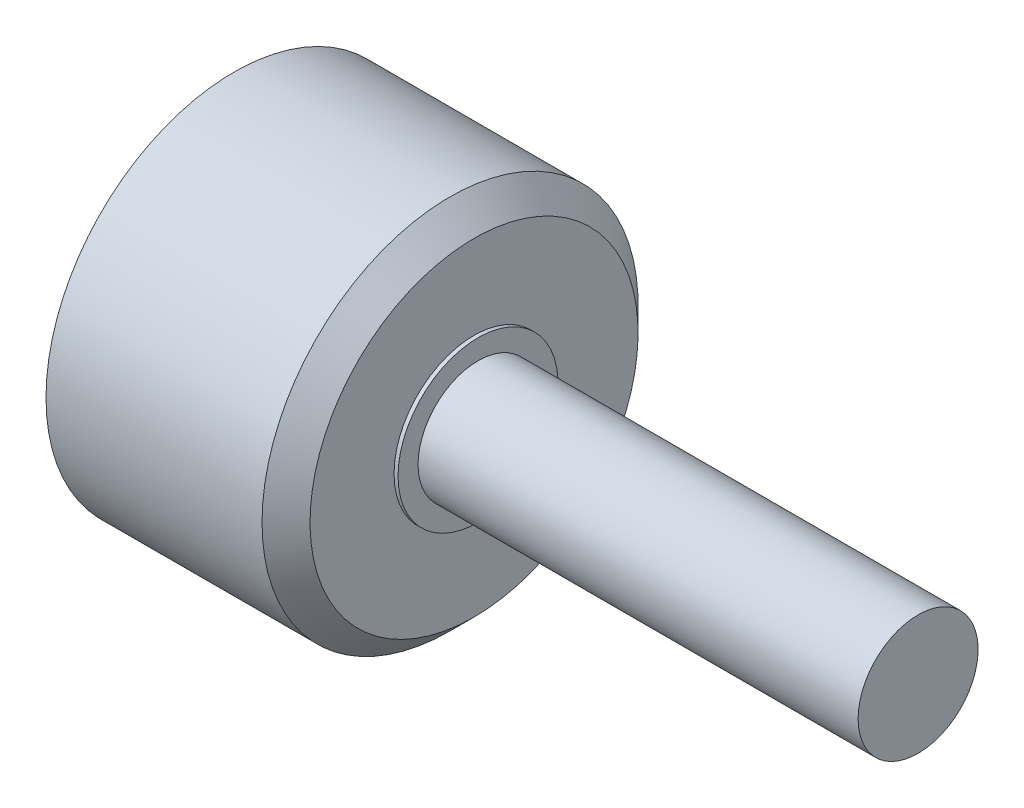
ISO-10303-21;
HEADER;
FILE_DESCRIPTION(('STEP AP214'),'2;1');
FILE_NAME('part.step','',(''),(''),'','','');
FILE_SCHEMA(('AUTOMOTIVE_DESIGN { 1 0 10303 214 1 1 1 1 }'));
ENDSEC;
DATA;
#1=APPLICATION_CONTEXT('core data for automotive mechanical design processes');
#2=APPLICATION_PROTOCOL_DEFINITION('international standard','automotive_design',2000,#1);
#3=PRODUCT_CONTEXT('',#1,'mechanical');
#4=PRODUCT('Part','Part','',(#3));
#5=PRODUCT_RELATED_PRODUCT_CATEGORY('part','',(#4));
#6=PRODUCT_DEFINITION_FORMATION('','',#4);
#7=PRODUCT_DEFINITION_CONTEXT('part definition',#1,'design');
#8=PRODUCT_DEFINITION('design','',#6,#7);
#9=PRODUCT_DEFINITION_SHAPE('','',#8);
#10=(LENGTH_UNIT() NAMED_UNIT(*) SI_UNIT(.MILLI.,.METRE.));
#11=(NAMED_UNIT(*) PLANE_ANGLE_UNIT() SI_UNIT($,.RADIAN.));
#12=(NAMED_UNIT(*) SI_UNIT($,.STERADIAN.) SOLID_ANGLE_UNIT());
#13=UNCERTAINTY_MEASURE_WITH_UNIT(LENGTH_MEASURE(1.E-05),#10,'distance_accuracy_value','');
#14=(GEOMETRIC_REPRESENTATION_CONTEXT(3) GLOBAL_UNCERTAINTY_ASSIGNED_CONTEXT((#13)) GLOBAL_UNIT_ASSIGNED_CONTEXT((#10,
#11,#12)) REPRESENTATION_CONTEXT('',''));
#15=CARTESIAN_POINT('',(0.,0.,0.));
#16=DIRECTION('',(0.,0.,1.));
#17=DIRECTION('',(1.,0.,0.));
#18=AXIS2_PLACEMENT_3D('',#15,#16,#17);
#19=CARTESIAN_POINT('',(85.5,0.,0.));
#20=DIRECTION('',(1.,0.,0.));
#21=DIRECTION('',(0.,0.,-1.));
#22=AXIS2_PLACEMENT_3D('',#19,#20,#21);
#23=PLANE('',#22);
#24=CARTESIAN_POINT('',(85.5,0.,0.));
#25=DIRECTION('',(-1.,0.,0.));
#26=DIRECTION('',(0.,0.,1.));
#27=AXIS2_PLACEMENT_3D('',#24,#25,#26);
#28=CIRCLE('',#27,7.5);
#29=CARTESIAN_POINT('',(85.5,0.,7.5));
#30=VERTEX_POINT('',#29);
#31=EDGE_CURVE('E18',#30,#30,#28,.T.);
#32=ORIENTED_EDGE('',*,*,#31,.F.);
#33=EDGE_LOOP('',(#32));
#34=FACE_BOUND('',#33,.T.);
#35=ADVANCED_FACE('F15',(#34),#23,.T.);
#36=CARTESIAN_POINT('',(85.5,0.,0.));
#37=DIRECTION('',(-1.,0.,0.));
#38=DIRECTION('',(0.,0.,1.));
#39=AXIS2_PLACEMENT_3D('',#36,#37,#38);
#40=CYLINDRICAL_SURFACE('',#39,7.5);
#41=CARTESIAN_POINT('',(30.5,0.,0.));
#42=DIRECTION('',(-1.,0.,0.));
#43=DIRECTION('',(0.,0.,1.));
#44=AXIS2_PLACEMENT_3D('',#41,#42,#43);
#45=CIRCLE('',#44,7.5);
#46=CARTESIAN_POINT('',(30.5,0.,7.5));
#47=VERTEX_POINT('',#46);
#48=EDGE_CURVE('E37',#47,#47,#45,.T.);
#49=ORIENTED_EDGE('',*,*,#48,.F.);
#50=EDGE_LOOP('',(#49));
#51=FACE_BOUND('',#50,.T.);
#52=ORIENTED_EDGE('',*,*,#31,.T.);
#53=EDGE_LOOP('',(#52));
#54=FACE_BOUND('',#53,.T.);
#55=ADVANCED_FACE('F44',(#51,#54),#40,.T.);
#56=CARTESIAN_POINT('',(30.5,0.,0.));
#57=DIRECTION('',(1.,0.,0.));
#58=DIRECTION('',(0.,0.,-1.));
#59=AXIS2_PLACEMENT_3D('',#56,#57,#58);
#60=PLANE('',#59);
#61=ORIENTED_EDGE('',*,*,#48,.T.);
#62=EDGE_LOOP('',(#61));
#63=FACE_BOUND('',#62,.T.);
#64=CARTESIAN_POINT('',(30.5,0.,0.));
#65=DIRECTION('',(-1.,0.,0.));
#66=DIRECTION('',(0.,0.,1.));
#67=AXIS2_PLACEMENT_3D('',#64,#65,#66);
#68=CIRCLE('',#67,10.);
#69=CARTESIAN_POINT('',(30.5,0.,10.));
#70=VERTEX_POINT('',#69);
#71=EDGE_CURVE('E35',#70,#70,#68,.T.);
#72=ORIENTED_EDGE('',*,*,#71,.F.);
#73=EDGE_LOOP('',(#72));
#74=FACE_BOUND('',#73,.T.);
#75=ADVANCED_FACE('F51',(#63,#74),#60,.T.);
#76=CARTESIAN_POINT('',(30.5,0.,0.));
#77=DIRECTION('',(-1.,0.,0.));
#78=DIRECTION('',(0.,0.,1.));
#79=AXIS2_PLACEMENT_3D('',#76,#77,#78);
#80=CYLINDRICAL_SURFACE('',#79,10.);
#81=CARTESIAN_POINT('',(30.,0.,0.));
#82=DIRECTION('',(-1.,0.,0.));
#83=DIRECTION('',(0.,0.,1.));
#84=AXIS2_PLACEMENT_3D('',#81,#82,#83);
#85=CIRCLE('',#84,10.);
#86=CARTESIAN_POINT('',(30.,0.,10.));
#87=VERTEX_POINT('',#86);
#88=EDGE_CURVE('E32',#87,#87,#85,.T.);
#89=ORIENTED_EDGE('',*,*,#88,.F.);
#90=EDGE_LOOP('',(#89));
#91=FACE_BOUND('',#90,.T.);
#92=ORIENTED_EDGE('',*,*,#71,.T.);
#93=EDGE_LOOP('',(#92));
#94=FACE_BOUND('',#93,.T.);
#95=ADVANCED_FACE('F71',(#91,#94),#80,.T.);
#96=CARTESIAN_POINT('',(30.,0.,0.));
#97=DIRECTION('',(1.,0.,0.));
#98=DIRECTION('',(0.,0.,-1.));
#99=AXIS2_PLACEMENT_3D('',#96,#97,#98);
#100=PLANE('',#99);
#101=ORIENTED_EDGE('',*,*,#88,.T.);
#102=EDGE_LOOP('',(#101));
#103=FACE_BOUND('',#102,.T.);
#104=CARTESIAN_POINT('',(30.,0.,0.));
#105=DIRECTION('',(-1.,0.,0.));
#106=DIRECTION('',(0.,-1.,0.));
#107=AXIS2_PLACEMENT_3D('',#104,#105,#106);
#108=CIRCLE('',#107,20.5);
#109=CARTESIAN_POINT('',(30.,-20.5,0.));
#110=VERTEX_POINT('',#109);
#111=EDGE_CURVE('E27',#110,#110,#108,.T.);
#112=ORIENTED_EDGE('',*,*,#111,.F.);
#113=EDGE_LOOP('',(#112));
#114=FACE_BOUND('',#113,.T.);
#115=ADVANCED_FACE('F67',(#103,#114),#100,.T.);
#116=CARTESIAN_POINT('',(27.,0.,0.));
#117=DIRECTION('',(-1.,0.,0.));
#118=DIRECTION('',(0.,-1.,0.));
#119=AXIS2_PLACEMENT_3D('',#116,#117,#118);
#120=CONICAL_SURFACE('',#119,23.5,0.785398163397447);
#121=CARTESIAN_POINT('',(27.,0.,0.));
#122=DIRECTION('',(-1.,0.,0.));
#123=DIRECTION('',(0.,0.,1.));
#124=AXIS2_PLACEMENT_3D('',#121,#122,#123);
#125=CIRCLE('',#124,23.5);
#126=CARTESIAN_POINT('',(27.,0.,23.5));
#127=VERTEX_POINT('',#126);
#128=EDGE_CURVE('E22',#127,#127,#125,.T.);
#129=ORIENTED_EDGE('',*,*,#128,.F.);
#130=EDGE_LOOP('',(#129));
#131=FACE_BOUND('',#130,.T.);
#132=ORIENTED_EDGE('',*,*,#111,.T.);
#133=EDGE_LOOP('',(#132));
#134=FACE_BOUND('',#133,.T.);
#135=ADVANCED_FACE('F60',(#131,#134),#120,.T.);
#136=CARTESIAN_POINT('',(0.,0.,0.));
#137=DIRECTION('',(1.,0.,0.));
#138=DIRECTION('',(0.,0.,-1.));
#139=AXIS2_PLACEMENT_3D('',#136,#137,#138);
#140=PLANE('',#139);
#141=CARTESIAN_POINT('',(0.,0.,0.));
#142=DIRECTION('',(-1.,0.,0.));
#143=DIRECTION('',(0.,0.,1.));
#144=AXIS2_PLACEMENT_3D('',#141,#142,#143);
#145=CIRCLE('',#144,23.5);
#146=CARTESIAN_POINT('',(0.,0.,23.5));
#147=VERTEX_POINT('',#146);
#148=EDGE_CURVE('E10',#147,#147,#145,.F.);
#149=ORIENTED_EDGE('',*,*,#148,.F.);
#150=EDGE_LOOP('',(#149));
#151=FACE_BOUND('',#150,.T.);
#152=ADVANCED_FACE('F55',(#151),#140,.F.);
#153=CARTESIAN_POINT('',(30.,0.,0.));
#154=DIRECTION('',(-1.,0.,0.));
#155=DIRECTION('',(0.,0.,1.));
#156=AXIS2_PLACEMENT_3D('',#153,#154,#155);
#157=CYLINDRICAL_SURFACE('',#156,23.5);
#158=ORIENTED_EDGE('',*,*,#148,.T.);
#159=EDGE_LOOP('',(#158));
#160=FACE_BOUND('',#159,.T.);
#161=ORIENTED_EDGE('',*,*,#128,.T.);
#162=EDGE_LOOP('',(#161));
#163=FACE_BOUND('',#162,.T.);
#164=ADVANCED_FACE('F53',(#160,#163),#157,.T.);
#165=CLOSED_SHELL('',(#35,#55,#75,#95,#115,#135,#152,#164));
#166=MANIFOLD_SOLID_BREP('B1',#165);
#167=ADVANCED_BREP_SHAPE_REPRESENTATION('',(#18,#166),#14);
#168=SHAPE_DEFINITION_REPRESENTATION(#9,#167);
ENDSEC;
END-ISO-10303-21;
